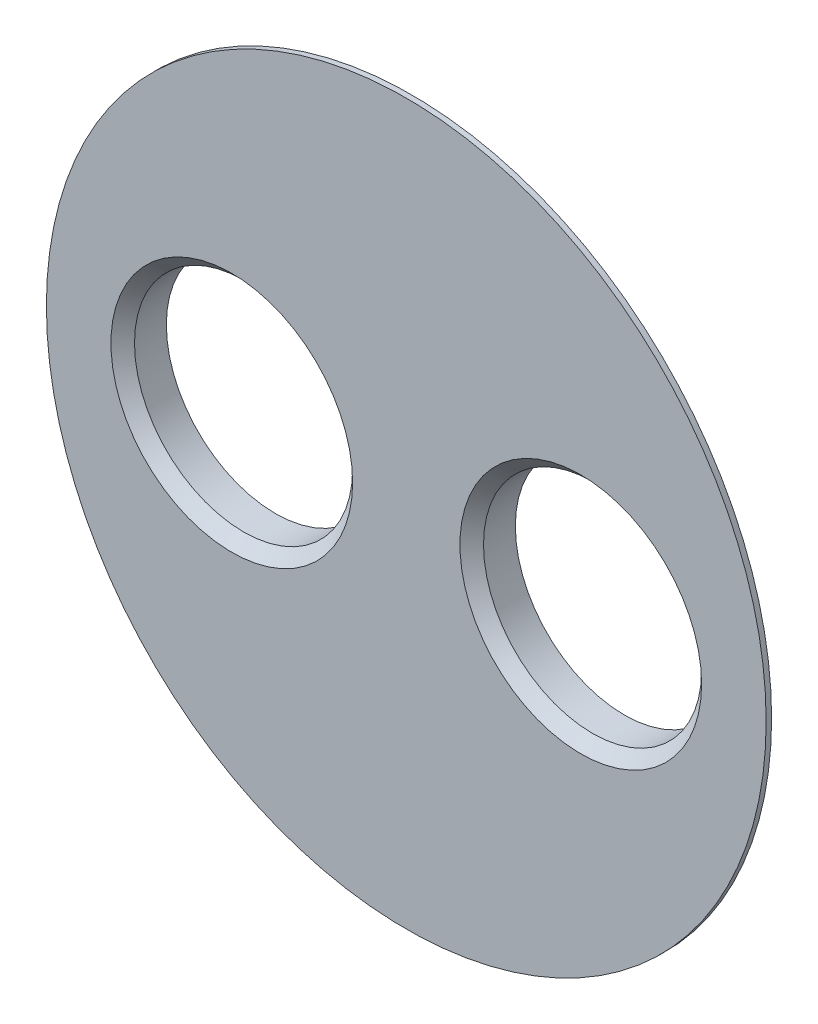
ISO-10303-21;
HEADER;
FILE_DESCRIPTION(('STEP AP214'),'2;1');
FILE_NAME('part.step','',(''),(''),'','','');
FILE_SCHEMA(('AUTOMOTIVE_DESIGN { 1 0 10303 214 1 1 1 1 }'));
ENDSEC;
DATA;
#1=APPLICATION_CONTEXT('core data for automotive mechanical design processes');
#2=APPLICATION_PROTOCOL_DEFINITION('international standard','automotive_design',2000,#1);
#3=PRODUCT_CONTEXT('',#1,'mechanical');
#4=PRODUCT('Part','Part','',(#3));
#5=PRODUCT_RELATED_PRODUCT_CATEGORY('part','',(#4));
#6=PRODUCT_DEFINITION_FORMATION('','',#4);
#7=PRODUCT_DEFINITION_CONTEXT('part definition',#1,'design');
#8=PRODUCT_DEFINITION('design','',#6,#7);
#9=PRODUCT_DEFINITION_SHAPE('','',#8);
#10=(LENGTH_UNIT() NAMED_UNIT(*) SI_UNIT(.MILLI.,.METRE.));
#11=(NAMED_UNIT(*) PLANE_ANGLE_UNIT() SI_UNIT($,.RADIAN.));
#12=(NAMED_UNIT(*) SI_UNIT($,.STERADIAN.) SOLID_ANGLE_UNIT());
#13=UNCERTAINTY_MEASURE_WITH_UNIT(LENGTH_MEASURE(1.E-05),#10,'distance_accuracy_value','');
#14=(GEOMETRIC_REPRESENTATION_CONTEXT(3) GLOBAL_UNCERTAINTY_ASSIGNED_CONTEXT((#13)) GLOBAL_UNIT_ASSIGNED_CONTEXT((#10,
#11,#12)) REPRESENTATION_CONTEXT('',''));
#15=CARTESIAN_POINT('',(0.,0.,0.));
#16=DIRECTION('',(0.,0.,1.));
#17=DIRECTION('',(1.,0.,0.));
#18=AXIS2_PLACEMENT_3D('',#15,#16,#17);
#19=CARTESIAN_POINT('',(0.,0.,10.));
#20=DIRECTION('',(0.,0.,-1.));
#21=DIRECTION('',(-1.,0.,0.));
#22=AXIS2_PLACEMENT_3D('',#19,#20,#21);
#23=CYLINDRICAL_SURFACE('',#22,82.5);
#24=CARTESIAN_POINT('',(0.,0.,8.75259422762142));
#25=DIRECTION('',(0.,0.,1.));
#26=DIRECTION('',(1.,0.,0.));
#27=AXIS2_PLACEMENT_3D('',#24,#25,#26);
#28=CIRCLE('',#27,82.5);
#29=CARTESIAN_POINT('',(82.5,0.,8.75259422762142));
#30=VERTEX_POINT('',#29);
#31=EDGE_CURVE('E49',#30,#30,#28,.T.);
#32=ORIENTED_EDGE('',*,*,#31,.T.);
#33=EDGE_LOOP('',(#32));
#34=FACE_BOUND('',#33,.T.);
#35=CARTESIAN_POINT('',(0.,0.,10.));
#36=DIRECTION('',(0.,0.,1.));
#37=DIRECTION('',(1.,0.,0.));
#38=AXIS2_PLACEMENT_3D('',#35,#36,#37);
#39=CIRCLE('',#38,82.5);
#40=CARTESIAN_POINT('',(82.5,0.,10.));
#41=VERTEX_POINT('',#40);
#42=EDGE_CURVE('E76',#41,#41,#39,.T.);
#43=ORIENTED_EDGE('',*,*,#42,.F.);
#44=EDGE_LOOP('',(#43));
#45=FACE_BOUND('',#44,.T.);
#46=ADVANCED_FACE('F40',(#34,#45),#23,.T.);
#47=CARTESIAN_POINT('',(0.,0.,10.));
#48=DIRECTION('',(0.,0.,1.));
#49=DIRECTION('',(1.,0.,0.));
#50=AXIS2_PLACEMENT_3D('',#47,#48,#49);
#51=PLANE('',#50);
#52=CARTESIAN_POINT('',(40.,0.,10.));
#53=DIRECTION('',(0.,0.,1.));
#54=DIRECTION('',(1.,0.,0.));
#55=AXIS2_PLACEMENT_3D('',#52,#53,#54);
#56=CIRCLE('',#55,27.7);
#57=CARTESIAN_POINT('',(67.7,0.,10.));
#58=VERTEX_POINT('',#57);
#59=EDGE_CURVE('E62',#58,#58,#56,.F.);
#60=ORIENTED_EDGE('',*,*,#59,.T.);
#61=EDGE_LOOP('',(#60));
#62=FACE_BOUND('',#61,.T.);
#63=CARTESIAN_POINT('',(-40.,0.,10.));
#64=DIRECTION('',(0.,0.,1.));
#65=DIRECTION('',(1.,0.,0.));
#66=AXIS2_PLACEMENT_3D('',#63,#64,#65);
#67=CIRCLE('',#66,27.7);
#68=CARTESIAN_POINT('',(-12.3,0.,10.));
#69=VERTEX_POINT('',#68);
#70=EDGE_CURVE('E68',#69,#69,#67,.F.);
#71=ORIENTED_EDGE('',*,*,#70,.T.);
#72=EDGE_LOOP('',(#71));
#73=FACE_BOUND('',#72,.T.);
#74=ORIENTED_EDGE('',*,*,#42,.T.);
#75=EDGE_LOOP('',(#74));
#76=FACE_BOUND('',#75,.T.);
#77=ADVANCED_FACE('F108',(#62,#73,#76),#51,.T.);
#78=CARTESIAN_POINT('',(0.,0.,0.));
#79=DIRECTION('',(0.,0.,1.));
#80=DIRECTION('',(1.,0.,0.));
#81=AXIS2_PLACEMENT_3D('',#78,#79,#80);
#82=PLANE('',#81);
#83=CARTESIAN_POINT('',(0.,0.,0.));
#84=DIRECTION('',(0.,0.,1.));
#85=DIRECTION('',(1.,0.,0.));
#86=AXIS2_PLACEMENT_3D('',#83,#84,#85);
#87=CIRCLE('',#86,69.9999999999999);
#88=CARTESIAN_POINT('',(69.9999999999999,0.,0.));
#89=VERTEX_POINT('',#88);
#90=EDGE_CURVE('E10',#89,#89,#87,.F.);
#91=ORIENTED_EDGE('',*,*,#90,.T.);
#92=EDGE_LOOP('',(#91));
#93=FACE_BOUND('',#92,.T.);
#94=CARTESIAN_POINT('',(-40.,0.,0.));
#95=DIRECTION('',(0.,0.,1.));
#96=DIRECTION('',(1.,0.,0.));
#97=AXIS2_PLACEMENT_3D('',#94,#95,#96);
#98=CIRCLE('',#97,25.);
#99=CARTESIAN_POINT('',(-15.,0.,0.));
#100=VERTEX_POINT('',#99);
#101=EDGE_CURVE('E80',#100,#100,#98,.T.);
#102=ORIENTED_EDGE('',*,*,#101,.T.);
#103=EDGE_LOOP('',(#102));
#104=FACE_BOUND('',#103,.T.);
#105=CARTESIAN_POINT('',(40.,0.,0.));
#106=DIRECTION('',(0.,0.,1.));
#107=DIRECTION('',(1.,0.,0.));
#108=AXIS2_PLACEMENT_3D('',#105,#106,#107);
#109=CIRCLE('',#108,25.);
#110=CARTESIAN_POINT('',(65.,0.,0.));
#111=VERTEX_POINT('',#110);
#112=EDGE_CURVE('E81',#111,#111,#109,.T.);
#113=ORIENTED_EDGE('',*,*,#112,.T.);
#114=EDGE_LOOP('',(#113));
#115=FACE_BOUND('',#114,.T.);
#116=ADVANCED_FACE('F89',(#93,#104,#115),#82,.F.);
#117=CARTESIAN_POINT('',(40.,0.,0.));
#118=DIRECTION('',(0.,0.,1.));
#119=DIRECTION('',(1.,0.,0.));
#120=AXIS2_PLACEMENT_3D('',#117,#118,#119);
#121=CYLINDRICAL_SURFACE('',#120,25.);
#122=CARTESIAN_POINT('',(40.,0.,7.29999999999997));
#123=DIRECTION('',(0.,0.,1.));
#124=DIRECTION('',(1.,0.,0.));
#125=AXIS2_PLACEMENT_3D('',#122,#123,#124);
#126=CIRCLE('',#125,25.);
#127=CARTESIAN_POINT('',(65.,0.,7.29999999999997));
#128=VERTEX_POINT('',#127);
#129=EDGE_CURVE('E72',#128,#128,#126,.T.);
#130=ORIENTED_EDGE('',*,*,#129,.T.);
#131=EDGE_LOOP('',(#130));
#132=FACE_BOUND('',#131,.T.);
#133=ORIENTED_EDGE('',*,*,#112,.F.);
#134=EDGE_LOOP('',(#133));
#135=FACE_BOUND('',#134,.T.);
#136=ADVANCED_FACE('F95',(#132,#135),#121,.F.);
#137=CARTESIAN_POINT('',(-40.,0.,0.));
#138=DIRECTION('',(0.,0.,1.));
#139=DIRECTION('',(1.,0.,0.));
#140=AXIS2_PLACEMENT_3D('',#137,#138,#139);
#141=CYLINDRICAL_SURFACE('',#140,25.);
#142=CARTESIAN_POINT('',(-40.,0.,7.29999999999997));
#143=DIRECTION('',(0.,0.,1.));
#144=DIRECTION('',(1.,0.,0.));
#145=AXIS2_PLACEMENT_3D('',#142,#143,#144);
#146=CIRCLE('',#145,25.);
#147=CARTESIAN_POINT('',(-15.,0.,7.29999999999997));
#148=VERTEX_POINT('',#147);
#149=EDGE_CURVE('E56',#148,#148,#146,.T.);
#150=ORIENTED_EDGE('',*,*,#149,.T.);
#151=EDGE_LOOP('',(#150));
#152=FACE_BOUND('',#151,.T.);
#153=ORIENTED_EDGE('',*,*,#101,.F.);
#154=EDGE_LOOP('',(#153));
#155=FACE_BOUND('',#154,.T.);
#156=ADVANCED_FACE('F92',(#152,#155),#141,.F.);
#157=CARTESIAN_POINT('',(40.,0.,7.29999999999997));
#158=DIRECTION('',(0.,0.,1.));
#159=DIRECTION('',(1.,0.,0.));
#160=AXIS2_PLACEMENT_3D('',#157,#158,#159);
#161=CONICAL_SURFACE('',#160,25.,0.785398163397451);
#162=ORIENTED_EDGE('',*,*,#59,.F.);
#163=EDGE_LOOP('',(#162));
#164=FACE_BOUND('',#163,.T.);
#165=ORIENTED_EDGE('',*,*,#129,.F.);
#166=EDGE_LOOP('',(#165));
#167=FACE_BOUND('',#166,.T.);
#168=ADVANCED_FACE('F94',(#164,#167),#161,.F.);
#169=CARTESIAN_POINT('',(-40.,0.,7.29999999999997));
#170=DIRECTION('',(0.,0.,1.));
#171=DIRECTION('',(1.,0.,0.));
#172=AXIS2_PLACEMENT_3D('',#169,#170,#171);
#173=CONICAL_SURFACE('',#172,25.,0.785398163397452);
#174=ORIENTED_EDGE('',*,*,#70,.F.);
#175=EDGE_LOOP('',(#174));
#176=FACE_BOUND('',#175,.T.);
#177=ORIENTED_EDGE('',*,*,#149,.F.);
#178=EDGE_LOOP('',(#177));
#179=FACE_BOUND('',#178,.T.);
#180=ADVANCED_FACE('F102',(#176,#179),#173,.F.);
#181=CARTESIAN_POINT('',(0.,0.,8.75259422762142));
#182=DIRECTION('',(0.,0.,1.));
#183=DIRECTION('',(1.,0.,0.));
#184=AXIS2_PLACEMENT_3D('',#181,#182,#183);
#185=CONICAL_SURFACE('',#184,82.5,0.959931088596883);
#186=ORIENTED_EDGE('',*,*,#90,.F.);
#187=EDGE_LOOP('',(#186));
#188=FACE_BOUND('',#187,.T.);
#189=ORIENTED_EDGE('',*,*,#31,.F.);
#190=EDGE_LOOP('',(#189));
#191=FACE_BOUND('',#190,.T.);
#192=ADVANCED_FACE('F43',(#188,#191),#185,.T.);
#193=CLOSED_SHELL('',(#46,#77,#116,#136,#156,#168,#180,#192));
#194=MANIFOLD_SOLID_BREP('B2',#193);
#195=ADVANCED_BREP_SHAPE_REPRESENTATION('',(#18,#194),#14);
#196=SHAPE_DEFINITION_REPRESENTATION(#9,#195);
ENDSEC;
END-ISO-10303-21;
